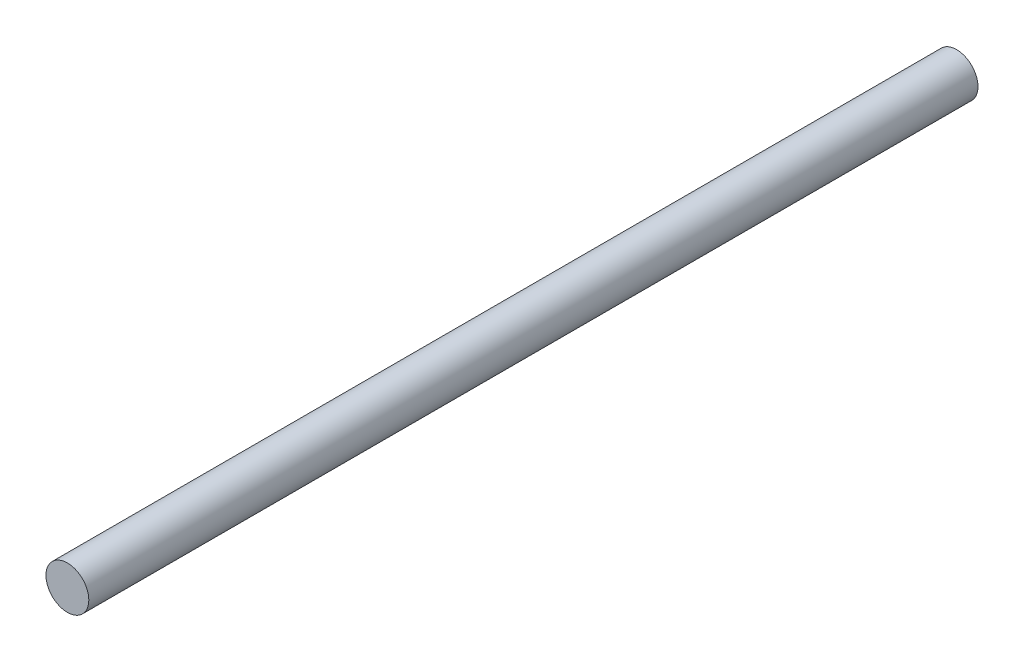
from build123d import *

# Parameters (mm, degrees)
ESQUISSE1_R      = 0.4
EXTRUSION1_DEPTH = 16.6


with BuildPart() as part:
    # Esquisse1 → Extrusion1 (new body)
    with BuildSketch(Plane.XY):
        Circle(ESQUISSE1_R)
    extrude(amount=EXTRUSION1_DEPTH)


solid = part.part
